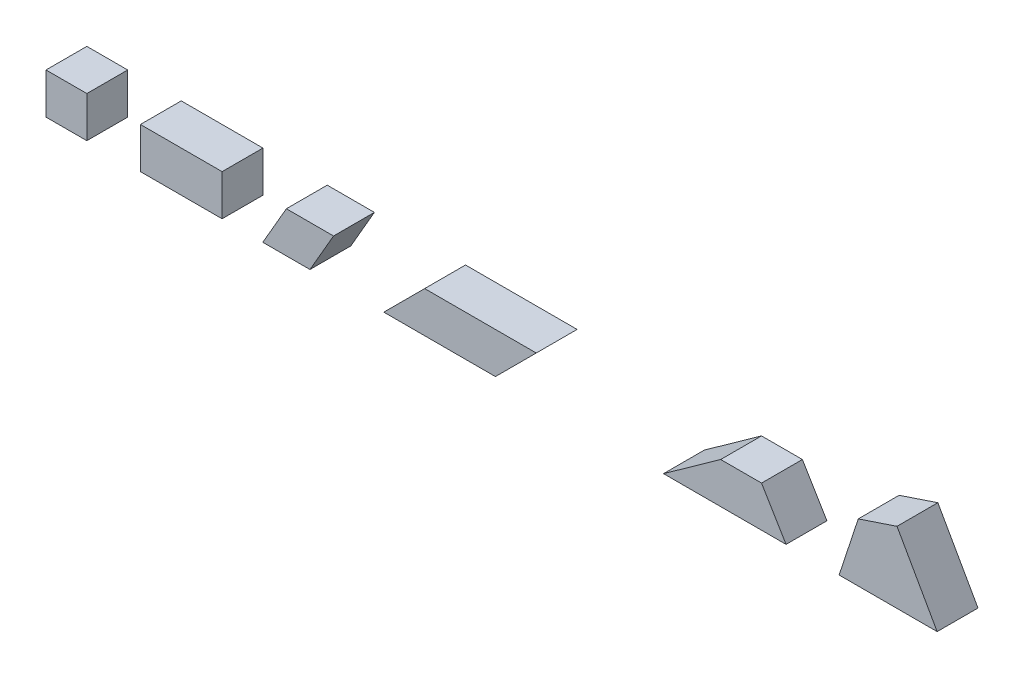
ISO-10303-21;
HEADER;
FILE_DESCRIPTION(('STEP AP214'),'2;1');
FILE_NAME('part.step','',(''),(''),'','','');
FILE_SCHEMA(('AUTOMOTIVE_DESIGN { 1 0 10303 214 1 1 1 1 }'));
ENDSEC;
DATA;
#1=APPLICATION_CONTEXT('core data for automotive mechanical design processes');
#2=APPLICATION_PROTOCOL_DEFINITION('international standard','automotive_design',2000,#1);
#3=PRODUCT_CONTEXT('',#1,'mechanical');
#4=PRODUCT('Part','Part','',(#3));
#5=PRODUCT_RELATED_PRODUCT_CATEGORY('part','',(#4));
#6=PRODUCT_DEFINITION_FORMATION('','',#4);
#7=PRODUCT_DEFINITION_CONTEXT('part definition',#1,'design');
#8=PRODUCT_DEFINITION('design','',#6,#7);
#9=PRODUCT_DEFINITION_SHAPE('','',#8);
#10=(LENGTH_UNIT() NAMED_UNIT(*) SI_UNIT(.MILLI.,.METRE.));
#11=(NAMED_UNIT(*) PLANE_ANGLE_UNIT() SI_UNIT($,.RADIAN.));
#12=(NAMED_UNIT(*) SI_UNIT($,.STERADIAN.) SOLID_ANGLE_UNIT());
#13=UNCERTAINTY_MEASURE_WITH_UNIT(LENGTH_MEASURE(1.E-05),#10,'distance_accuracy_value','');
#14=(GEOMETRIC_REPRESENTATION_CONTEXT(3) GLOBAL_UNCERTAINTY_ASSIGNED_CONTEXT((#13)) GLOBAL_UNIT_ASSIGNED_CONTEXT((#10,
#11,#12)) REPRESENTATION_CONTEXT('',''));
#15=CARTESIAN_POINT('',(0.,0.,0.));
#16=DIRECTION('',(0.,0.,1.));
#17=DIRECTION('',(1.,0.,0.));
#18=AXIS2_PLACEMENT_3D('',#15,#16,#17);
#19=CARTESIAN_POINT('',(994.197649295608,71.2438319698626,50.));
#20=DIRECTION('',(0.949917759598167,-0.312499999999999,0.));
#21=DIRECTION('',(0.312499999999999,0.949917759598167,0.));
#22=AXIS2_PLACEMENT_3D('',#19,#20,#21);
#23=PLANE('',#22);
#24=DIRECTION('',(-0.312499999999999,-0.949917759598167,0.));
#25=VECTOR('',#24,1.);
#26=CARTESIAN_POINT('',(994.197649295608,71.2438319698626,0.));
#27=LINE('',#26,#25);
#28=CARTESIAN_POINT('',(994.197649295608,71.2438319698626,0.));
#29=VERTEX_POINT('',#28);
#30=CARTESIAN_POINT('',(970.760149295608,0.,0.));
#31=VERTEX_POINT('',#30);
#32=EDGE_CURVE('E86',#29,#31,#27,.T.);
#33=ORIENTED_EDGE('',*,*,#32,.T.);
#34=DIRECTION('',(0.,0.,-1.));
#35=VECTOR('',#34,1.);
#36=CARTESIAN_POINT('',(970.760149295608,0.,50.));
#37=LINE('',#36,#35);
#38=CARTESIAN_POINT('',(970.760149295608,0.,50.));
#39=VERTEX_POINT('',#38);
#40=EDGE_CURVE('E12',#39,#31,#37,.T.);
#41=ORIENTED_EDGE('',*,*,#40,.F.);
#42=DIRECTION('',(-0.312499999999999,-0.949917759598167,0.));
#43=VECTOR('',#42,1.);
#44=CARTESIAN_POINT('',(994.197649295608,71.2438319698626,50.));
#45=LINE('',#44,#43);
#46=CARTESIAN_POINT('',(994.197649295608,71.2438319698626,50.));
#47=VERTEX_POINT('',#46);
#48=EDGE_CURVE('E104',#47,#39,#45,.T.);
#49=ORIENTED_EDGE('',*,*,#48,.F.);
#50=DIRECTION('',(0.,0.,-1.));
#51=VECTOR('',#50,1.);
#52=CARTESIAN_POINT('',(994.197649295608,71.2438319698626,50.));
#53=LINE('',#52,#51);
#54=EDGE_CURVE('E98',#47,#29,#53,.T.);
#55=ORIENTED_EDGE('',*,*,#54,.T.);
#56=EDGE_LOOP('',(#33,#41,#49,#55));
#57=FACE_BOUND('',#56,.T.);
#58=ADVANCED_FACE('F42',(#57),#23,.F.);
#59=CARTESIAN_POINT('',(970.760149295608,0.,50.));
#60=DIRECTION('',(0.,1.,0.));
#61=DIRECTION('',(-1.,0.,0.));
#62=AXIS2_PLACEMENT_3D('',#59,#60,#61);
#63=PLANE('',#62);
#64=DIRECTION('',(1.,0.,0.));
#65=VECTOR('',#64,1.);
#66=CARTESIAN_POINT('',(970.760149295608,0.,0.));
#67=LINE('',#66,#65);
#68=CARTESIAN_POINT('',(1090.76014929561,0.,0.));
#69=VERTEX_POINT('',#68);
#70=EDGE_CURVE('E82',#31,#69,#67,.T.);
#71=ORIENTED_EDGE('',*,*,#70,.T.);
#72=DIRECTION('',(0.,0.,-1.));
#73=VECTOR('',#72,1.);
#74=CARTESIAN_POINT('',(1090.76014929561,0.,50.));
#75=LINE('',#74,#73);
#76=CARTESIAN_POINT('',(1090.76014929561,0.,50.));
#77=VERTEX_POINT('',#76);
#78=EDGE_CURVE('E49',#77,#69,#75,.T.);
#79=ORIENTED_EDGE('',*,*,#78,.F.);
#80=DIRECTION('',(1.,0.,0.));
#81=VECTOR('',#80,1.);
#82=CARTESIAN_POINT('',(970.760149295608,0.,50.));
#83=LINE('',#82,#81);
#84=EDGE_CURVE('E94',#39,#77,#83,.T.);
#85=ORIENTED_EDGE('',*,*,#84,.F.);
#86=ORIENTED_EDGE('',*,*,#40,.T.);
#87=EDGE_LOOP('',(#71,#79,#85,#86));
#88=FACE_BOUND('',#87,.T.);
#89=ADVANCED_FACE('F93',(#88),#63,.F.);
#90=CARTESIAN_POINT('',(1090.76014929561,0.,50.));
#91=DIRECTION('',(-0.8709288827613,-0.491409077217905,0.));
#92=DIRECTION('',(0.491409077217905,-0.8709288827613,0.));
#93=AXIS2_PLACEMENT_3D('',#90,#91,#92);
#94=PLANE('',#93);
#95=DIRECTION('',(-0.491409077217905,0.8709288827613,0.));
#96=VECTOR('',#95,1.);
#97=CARTESIAN_POINT('',(1090.76014929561,0.,0.));
#98=LINE('',#97,#96);
#99=CARTESIAN_POINT('',(1041.61924157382,87.0928882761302,0.));
#100=VERTEX_POINT('',#99);
#101=EDGE_CURVE('E87',#69,#100,#98,.T.);
#102=ORIENTED_EDGE('',*,*,#101,.T.);
#103=DIRECTION('',(0.,0.,-1.));
#104=VECTOR('',#103,1.);
#105=CARTESIAN_POINT('',(1041.61924157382,87.0928882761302,50.));
#106=LINE('',#105,#104);
#107=CARTESIAN_POINT('',(1041.61924157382,87.0928882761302,50.));
#108=VERTEX_POINT('',#107);
#109=EDGE_CURVE('E110',#108,#100,#106,.T.);
#110=ORIENTED_EDGE('',*,*,#109,.F.);
#111=DIRECTION('',(-0.491409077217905,0.8709288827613,0.));
#112=VECTOR('',#111,1.);
#113=CARTESIAN_POINT('',(1090.76014929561,0.,50.));
#114=LINE('',#113,#112);
#115=EDGE_CURVE('E61',#77,#108,#114,.T.);
#116=ORIENTED_EDGE('',*,*,#115,.F.);
#117=ORIENTED_EDGE('',*,*,#78,.T.);
#118=EDGE_LOOP('',(#102,#110,#116,#117));
#119=FACE_BOUND('',#118,.T.);
#120=ADVANCED_FACE('F113',(#119),#94,.F.);
#121=CARTESIAN_POINT('',(1041.61924157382,87.0928882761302,50.));
#122=DIRECTION('',(0.316981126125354,-0.948431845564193,0.));
#123=DIRECTION('',(0.948431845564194,0.316981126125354,0.));
#124=AXIS2_PLACEMENT_3D('',#121,#122,#123);
#125=PLANE('',#124);
#126=DIRECTION('',(-0.948431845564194,-0.316981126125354,0.));
#127=VECTOR('',#126,1.);
#128=CARTESIAN_POINT('',(1041.61924157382,87.0928882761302,0.));
#129=LINE('',#128,#127);
#130=EDGE_CURVE('E102',#100,#29,#129,.T.);
#131=ORIENTED_EDGE('',*,*,#130,.T.);
#132=ORIENTED_EDGE('',*,*,#54,.F.);
#133=DIRECTION('',(-0.948431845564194,-0.316981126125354,0.));
#134=VECTOR('',#133,1.);
#135=CARTESIAN_POINT('',(1041.61924157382,87.0928882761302,50.));
#136=LINE('',#135,#134);
#137=EDGE_CURVE('E56',#108,#47,#136,.T.);
#138=ORIENTED_EDGE('',*,*,#137,.F.);
#139=ORIENTED_EDGE('',*,*,#109,.T.);
#140=EDGE_LOOP('',(#131,#132,#138,#139));
#141=FACE_BOUND('',#140,.T.);
#142=ADVANCED_FACE('F115',(#141),#125,.F.);
#143=CARTESIAN_POINT('',(970.760149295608,0.,50.));
#144=DIRECTION('',(0.,0.,1.));
#145=DIRECTION('',(1.,0.,0.));
#146=AXIS2_PLACEMENT_3D('',#143,#144,#145);
#147=PLANE('',#146);
#148=ORIENTED_EDGE('',*,*,#48,.T.);
#149=ORIENTED_EDGE('',*,*,#84,.T.);
#150=ORIENTED_EDGE('',*,*,#115,.T.);
#151=ORIENTED_EDGE('',*,*,#137,.T.);
#152=EDGE_LOOP('',(#148,#149,#150,#151));
#153=FACE_BOUND('',#152,.T.);
#154=ADVANCED_FACE('F116',(#153),#147,.T.);
#155=CARTESIAN_POINT('',(970.760149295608,0.,0.));
#156=DIRECTION('',(0.,0.,1.));
#157=DIRECTION('',(1.,0.,0.));
#158=AXIS2_PLACEMENT_3D('',#155,#156,#157);
#159=PLANE('',#158);
#160=ORIENTED_EDGE('',*,*,#32,.F.);
#161=ORIENTED_EDGE('',*,*,#130,.F.);
#162=ORIENTED_EDGE('',*,*,#101,.F.);
#163=ORIENTED_EDGE('',*,*,#70,.F.);
#164=EDGE_LOOP('',(#160,#161,#162,#163));
#165=FACE_BOUND('',#164,.T.);
#166=ADVANCED_FACE('F83',(#165),#159,.F.);
#167=CLOSED_SHELL('',(#58,#89,#120,#142,#154,#166));
#168=MANIFOLD_SOLID_BREP('B2',#167);
#169=CARTESIAN_POINT('',(550.0755337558,0.,50.));
#170=DIRECTION('',(-0.707106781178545,0.707106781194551,0.));
#171=DIRECTION('',(-0.707106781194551,-0.707106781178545,0.));
#172=AXIS2_PLACEMENT_3D('',#169,#170,#171);
#173=PLANE('',#172);
#174=DIRECTION('',(0.707106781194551,0.707106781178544,0.));
#175=VECTOR('',#174,1.);
#176=CARTESIAN_POINT('',(550.0755337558,0.,0.));
#177=LINE('',#176,#175);
#178=CARTESIAN_POINT('',(550.0755337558,0.,0.));
#179=VERTEX_POINT('',#178);
#180=CARTESIAN_POINT('',(600.075533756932,50.,0.));
#181=VERTEX_POINT('',#180);
#182=EDGE_CURVE('E208',#179,#181,#177,.T.);
#183=ORIENTED_EDGE('',*,*,#182,.T.);
#184=DIRECTION('',(0.,0.,-1.));
#185=VECTOR('',#184,1.);
#186=CARTESIAN_POINT('',(600.075533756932,50.,50.));
#187=LINE('',#186,#185);
#188=CARTESIAN_POINT('',(600.075533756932,50.,50.));
#189=VERTEX_POINT('',#188);
#190=EDGE_CURVE('E40',#189,#181,#187,.T.);
#191=ORIENTED_EDGE('',*,*,#190,.F.);
#192=DIRECTION('',(0.707106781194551,0.707106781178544,0.));
#193=VECTOR('',#192,1.);
#194=CARTESIAN_POINT('',(550.0755337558,0.,50.));
#195=LINE('',#194,#193);
#196=CARTESIAN_POINT('',(550.0755337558,0.,50.));
#197=VERTEX_POINT('',#196);
#198=EDGE_CURVE('E226',#197,#189,#195,.T.);
#199=ORIENTED_EDGE('',*,*,#198,.F.);
#200=DIRECTION('',(0.,0.,-1.));
#201=VECTOR('',#200,1.);
#202=CARTESIAN_POINT('',(550.0755337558,0.,50.));
#203=LINE('',#202,#201);
#204=EDGE_CURVE('E220',#197,#179,#203,.T.);
#205=ORIENTED_EDGE('',*,*,#204,.T.);
#206=EDGE_LOOP('',(#183,#191,#199,#205));
#207=FACE_BOUND('',#206,.T.);
#208=ADVANCED_FACE('F164',(#207),#173,.F.);
#209=CARTESIAN_POINT('',(600.075533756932,50.,50.));
#210=DIRECTION('',(0.,-1.,0.));
#211=DIRECTION('',(0.,0.,-1.));
#212=AXIS2_PLACEMENT_3D('',#209,#210,#211);
#213=PLANE('',#212);
#214=DIRECTION('',(-1.,0.,0.));
#215=VECTOR('',#214,1.);
#216=CARTESIAN_POINT('',(600.075533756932,50.,0.));
#217=LINE('',#216,#215);
#218=CARTESIAN_POINT('',(463.472993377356,50.,0.));
#219=VERTEX_POINT('',#218);
#220=EDGE_CURVE('E204',#181,#219,#217,.T.);
#221=ORIENTED_EDGE('',*,*,#220,.T.);
#222=DIRECTION('',(0.,0.,-1.));
#223=VECTOR('',#222,1.);
#224=CARTESIAN_POINT('',(463.472993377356,50.,50.));
#225=LINE('',#224,#223);
#226=CARTESIAN_POINT('',(463.472993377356,50.,50.));
#227=VERTEX_POINT('',#226);
#228=EDGE_CURVE('E171',#227,#219,#225,.T.);
#229=ORIENTED_EDGE('',*,*,#228,.F.);
#230=DIRECTION('',(-1.,0.,0.));
#231=VECTOR('',#230,1.);
#232=CARTESIAN_POINT('',(600.075533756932,50.,50.));
#233=LINE('',#232,#231);
#234=EDGE_CURVE('E216',#189,#227,#233,.T.);
#235=ORIENTED_EDGE('',*,*,#234,.F.);
#236=ORIENTED_EDGE('',*,*,#190,.T.);
#237=EDGE_LOOP('',(#221,#229,#235,#236));
#238=FACE_BOUND('',#237,.T.);
#239=ADVANCED_FACE('F215',(#238),#213,.F.);
#240=CARTESIAN_POINT('',(463.472993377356,50.,50.));
#241=DIRECTION('',(0.707106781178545,-0.70710678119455,0.));
#242=DIRECTION('',(0.70710678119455,0.707106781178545,0.));
#243=AXIS2_PLACEMENT_3D('',#240,#241,#242);
#244=PLANE('',#243);
#245=DIRECTION('',(-0.70710678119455,-0.707106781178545,0.));
#246=VECTOR('',#245,1.);
#247=CARTESIAN_POINT('',(463.472993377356,50.,0.));
#248=LINE('',#247,#246);
#249=CARTESIAN_POINT('',(413.472993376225,0.,0.));
#250=VERTEX_POINT('',#249);
#251=EDGE_CURVE('E209',#219,#250,#248,.T.);
#252=ORIENTED_EDGE('',*,*,#251,.T.);
#253=DIRECTION('',(0.,0.,-1.));
#254=VECTOR('',#253,1.);
#255=CARTESIAN_POINT('',(413.472993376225,0.,50.));
#256=LINE('',#255,#254);
#257=CARTESIAN_POINT('',(413.472993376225,0.,50.));
#258=VERTEX_POINT('',#257);
#259=EDGE_CURVE('E232',#258,#250,#256,.T.);
#260=ORIENTED_EDGE('',*,*,#259,.F.);
#261=DIRECTION('',(-0.70710678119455,-0.707106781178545,0.));
#262=VECTOR('',#261,1.);
#263=CARTESIAN_POINT('',(463.472993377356,50.,50.));
#264=LINE('',#263,#262);
#265=EDGE_CURVE('E183',#227,#258,#264,.T.);
#266=ORIENTED_EDGE('',*,*,#265,.F.);
#267=ORIENTED_EDGE('',*,*,#228,.T.);
#268=EDGE_LOOP('',(#252,#260,#266,#267));
#269=FACE_BOUND('',#268,.T.);
#270=ADVANCED_FACE('F235',(#269),#244,.F.);
#271=CARTESIAN_POINT('',(413.472993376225,0.,50.));
#272=DIRECTION('',(0.,1.,0.));
#273=DIRECTION('',(0.,0.,1.));
#274=AXIS2_PLACEMENT_3D('',#271,#272,#273);
#275=PLANE('',#274);
#276=DIRECTION('',(1.,0.,0.));
#277=VECTOR('',#276,1.);
#278=CARTESIAN_POINT('',(413.472993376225,0.,0.));
#279=LINE('',#278,#277);
#280=EDGE_CURVE('E224',#250,#179,#279,.T.);
#281=ORIENTED_EDGE('',*,*,#280,.T.);
#282=ORIENTED_EDGE('',*,*,#204,.F.);
#283=DIRECTION('',(1.,0.,0.));
#284=VECTOR('',#283,1.);
#285=CARTESIAN_POINT('',(413.472993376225,0.,50.));
#286=LINE('',#285,#284);
#287=EDGE_CURVE('E178',#258,#197,#286,.T.);
#288=ORIENTED_EDGE('',*,*,#287,.F.);
#289=ORIENTED_EDGE('',*,*,#259,.T.);
#290=EDGE_LOOP('',(#281,#282,#288,#289));
#291=FACE_BOUND('',#290,.T.);
#292=ADVANCED_FACE('F237',(#291),#275,.F.);
#293=CARTESIAN_POINT('',(600.075533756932,50.,50.));
#294=DIRECTION('',(0.,0.,1.));
#295=DIRECTION('',(1.,0.,0.));
#296=AXIS2_PLACEMENT_3D('',#293,#294,#295);
#297=PLANE('',#296);
#298=ORIENTED_EDGE('',*,*,#198,.T.);
#299=ORIENTED_EDGE('',*,*,#234,.T.);
#300=ORIENTED_EDGE('',*,*,#265,.T.);
#301=ORIENTED_EDGE('',*,*,#287,.T.);
#302=EDGE_LOOP('',(#298,#299,#300,#301));
#303=FACE_BOUND('',#302,.T.);
#304=ADVANCED_FACE('F238',(#303),#297,.T.);
#305=CARTESIAN_POINT('',(600.075533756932,50.,0.));
#306=DIRECTION('',(0.,0.,1.));
#307=DIRECTION('',(1.,0.,0.));
#308=AXIS2_PLACEMENT_3D('',#305,#306,#307);
#309=PLANE('',#308);
#310=ORIENTED_EDGE('',*,*,#182,.F.);
#311=ORIENTED_EDGE('',*,*,#280,.F.);
#312=ORIENTED_EDGE('',*,*,#251,.F.);
#313=ORIENTED_EDGE('',*,*,#220,.F.);
#314=EDGE_LOOP('',(#310,#311,#312,#313));
#315=FACE_BOUND('',#314,.T.);
#316=ADVANCED_FACE('F205',(#315),#309,.F.);
#317=CLOSED_SHELL('',(#208,#239,#270,#292,#304,#316));
#318=MANIFOLD_SOLID_BREP('B6',#317);
#319=CARTESIAN_POINT('',(323.086690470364,0.,50.));
#320=DIRECTION('',(-0.866025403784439,0.499999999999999,0.));
#321=DIRECTION('',(-0.5,-0.866025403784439,0.));
#322=AXIS2_PLACEMENT_3D('',#319,#320,#321);
#323=PLANE('',#322);
#324=DIRECTION('',(0.499999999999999,0.866025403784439,0.));
#325=VECTOR('',#324,1.);
#326=CARTESIAN_POINT('',(323.086690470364,0.,0.));
#327=LINE('',#326,#325);
#328=CARTESIAN_POINT('',(323.086690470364,0.,0.));
#329=VERTEX_POINT('',#328);
#330=CARTESIAN_POINT('',(351.954203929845,50.,0.));
#331=VERTEX_POINT('',#330);
#332=EDGE_CURVE('E330',#329,#331,#327,.T.);
#333=ORIENTED_EDGE('',*,*,#332,.T.);
#334=DIRECTION('',(0.,0.,-1.));
#335=VECTOR('',#334,1.);
#336=CARTESIAN_POINT('',(351.954203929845,50.,50.));
#337=LINE('',#336,#335);
#338=CARTESIAN_POINT('',(351.954203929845,50.,50.));
#339=VERTEX_POINT('',#338);
#340=EDGE_CURVE('E162',#339,#331,#337,.T.);
#341=ORIENTED_EDGE('',*,*,#340,.F.);
#342=DIRECTION('',(0.499999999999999,0.866025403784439,0.));
#343=VECTOR('',#342,1.);
#344=CARTESIAN_POINT('',(323.086690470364,0.,50.));
#345=LINE('',#344,#343);
#346=CARTESIAN_POINT('',(323.086690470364,0.,50.));
#347=VERTEX_POINT('',#346);
#348=EDGE_CURVE('E348',#347,#339,#345,.T.);
#349=ORIENTED_EDGE('',*,*,#348,.F.);
#350=DIRECTION('',(0.,0.,-1.));
#351=VECTOR('',#350,1.);
#352=CARTESIAN_POINT('',(323.086690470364,0.,50.));
#353=LINE('',#352,#351);
#354=EDGE_CURVE('E342',#347,#329,#353,.T.);
#355=ORIENTED_EDGE('',*,*,#354,.T.);
#356=EDGE_LOOP('',(#333,#341,#349,#355));
#357=FACE_BOUND('',#356,.T.);
#358=ADVANCED_FACE('F286',(#357),#323,.F.);
#359=CARTESIAN_POINT('',(351.954203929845,50.,50.));
#360=DIRECTION('',(0.,-1.,0.));
#361=DIRECTION('',(1.,0.,0.));
#362=AXIS2_PLACEMENT_3D('',#359,#360,#361);
#363=PLANE('',#362);
#364=DIRECTION('',(-1.,0.,0.));
#365=VECTOR('',#364,1.);
#366=CARTESIAN_POINT('',(351.954203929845,50.,0.));
#367=LINE('',#366,#365);
#368=CARTESIAN_POINT('',(294.219177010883,50.,0.));
#369=VERTEX_POINT('',#368);
#370=EDGE_CURVE('E326',#331,#369,#367,.T.);
#371=ORIENTED_EDGE('',*,*,#370,.T.);
#372=DIRECTION('',(0.,0.,-1.));
#373=VECTOR('',#372,1.);
#374=CARTESIAN_POINT('',(294.219177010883,50.,50.));
#375=LINE('',#374,#373);
#376=CARTESIAN_POINT('',(294.219177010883,50.,50.));
#377=VERTEX_POINT('',#376);
#378=EDGE_CURVE('E293',#377,#369,#375,.T.);
#379=ORIENTED_EDGE('',*,*,#378,.F.);
#380=DIRECTION('',(-1.,0.,0.));
#381=VECTOR('',#380,1.);
#382=CARTESIAN_POINT('',(351.954203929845,50.,50.));
#383=LINE('',#382,#381);
#384=EDGE_CURVE('E338',#339,#377,#383,.T.);
#385=ORIENTED_EDGE('',*,*,#384,.F.);
#386=ORIENTED_EDGE('',*,*,#340,.T.);
#387=EDGE_LOOP('',(#371,#379,#385,#386));
#388=FACE_BOUND('',#387,.T.);
#389=ADVANCED_FACE('F337',(#388),#363,.F.);
#390=CARTESIAN_POINT('',(294.219177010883,50.,50.));
#391=DIRECTION('',(0.866025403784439,-0.499999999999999,0.));
#392=DIRECTION('',(0.499999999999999,0.866025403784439,0.));
#393=AXIS2_PLACEMENT_3D('',#390,#391,#392);
#394=PLANE('',#393);
#395=DIRECTION('',(-0.499999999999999,-0.866025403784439,0.));
#396=VECTOR('',#395,1.);
#397=CARTESIAN_POINT('',(294.219177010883,50.,0.));
#398=LINE('',#397,#396);
#399=CARTESIAN_POINT('',(265.351663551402,0.,0.));
#400=VERTEX_POINT('',#399);
#401=EDGE_CURVE('E331',#369,#400,#398,.T.);
#402=ORIENTED_EDGE('',*,*,#401,.T.);
#403=DIRECTION('',(0.,0.,-1.));
#404=VECTOR('',#403,1.);
#405=CARTESIAN_POINT('',(265.351663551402,0.,50.));
#406=LINE('',#405,#404);
#407=CARTESIAN_POINT('',(265.351663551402,0.,50.));
#408=VERTEX_POINT('',#407);
#409=EDGE_CURVE('E354',#408,#400,#406,.T.);
#410=ORIENTED_EDGE('',*,*,#409,.F.);
#411=DIRECTION('',(-0.499999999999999,-0.866025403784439,0.));
#412=VECTOR('',#411,1.);
#413=CARTESIAN_POINT('',(294.219177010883,50.,50.));
#414=LINE('',#413,#412);
#415=EDGE_CURVE('E305',#377,#408,#414,.T.);
#416=ORIENTED_EDGE('',*,*,#415,.F.);
#417=ORIENTED_EDGE('',*,*,#378,.T.);
#418=EDGE_LOOP('',(#402,#410,#416,#417));
#419=FACE_BOUND('',#418,.T.);
#420=ADVANCED_FACE('F357',(#419),#394,.F.);
#421=CARTESIAN_POINT('',(265.351663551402,0.,50.));
#422=DIRECTION('',(0.,1.,0.));
#423=DIRECTION('',(-1.,0.,0.));
#424=AXIS2_PLACEMENT_3D('',#421,#422,#423);
#425=PLANE('',#424);
#426=DIRECTION('',(1.,0.,0.));
#427=VECTOR('',#426,1.);
#428=CARTESIAN_POINT('',(265.351663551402,0.,0.));
#429=LINE('',#428,#427);
#430=EDGE_CURVE('E346',#400,#329,#429,.T.);
#431=ORIENTED_EDGE('',*,*,#430,.T.);
#432=ORIENTED_EDGE('',*,*,#354,.F.);
#433=DIRECTION('',(1.,0.,0.));
#434=VECTOR('',#433,1.);
#435=CARTESIAN_POINT('',(265.351663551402,0.,50.));
#436=LINE('',#435,#434);
#437=EDGE_CURVE('E300',#408,#347,#436,.T.);
#438=ORIENTED_EDGE('',*,*,#437,.F.);
#439=ORIENTED_EDGE('',*,*,#409,.T.);
#440=EDGE_LOOP('',(#431,#432,#438,#439));
#441=FACE_BOUND('',#440,.T.);
#442=ADVANCED_FACE('F359',(#441),#425,.F.);
#443=CARTESIAN_POINT('',(351.954203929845,50.,50.));
#444=DIRECTION('',(0.,0.,1.));
#445=DIRECTION('',(1.,0.,0.));
#446=AXIS2_PLACEMENT_3D('',#443,#444,#445);
#447=PLANE('',#446);
#448=ORIENTED_EDGE('',*,*,#348,.T.);
#449=ORIENTED_EDGE('',*,*,#384,.T.);
#450=ORIENTED_EDGE('',*,*,#415,.T.);
#451=ORIENTED_EDGE('',*,*,#437,.T.);
#452=EDGE_LOOP('',(#448,#449,#450,#451));
#453=FACE_BOUND('',#452,.T.);
#454=ADVANCED_FACE('F360',(#453),#447,.T.);
#455=CARTESIAN_POINT('',(351.954203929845,50.,0.));
#456=DIRECTION('',(0.,0.,1.));
#457=DIRECTION('',(1.,0.,0.));
#458=AXIS2_PLACEMENT_3D('',#455,#456,#457);
#459=PLANE('',#458);
#460=ORIENTED_EDGE('',*,*,#332,.F.);
#461=ORIENTED_EDGE('',*,*,#430,.F.);
#462=ORIENTED_EDGE('',*,*,#401,.F.);
#463=ORIENTED_EDGE('',*,*,#370,.F.);
#464=EDGE_LOOP('',(#460,#461,#462,#463));
#465=FACE_BOUND('',#464,.T.);
#466=ADVANCED_FACE('F327',(#465),#459,.F.);
#467=CLOSED_SHELL('',(#358,#389,#420,#442,#454,#466));
#468=MANIFOLD_SOLID_BREP('B34',#467);
#469=CARTESIAN_POINT('',(825.828612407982,50.,50.));
#470=DIRECTION('',(0.581238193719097,-0.813733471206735,0.));
#471=DIRECTION('',(0.813733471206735,0.581238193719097,0.));
#472=AXIS2_PLACEMENT_3D('',#469,#470,#471);
#473=PLANE('',#472);
#474=DIRECTION('',(-0.813733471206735,-0.581238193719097,0.));
#475=VECTOR('',#474,1.);
#476=CARTESIAN_POINT('',(825.828612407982,50.,0.));
#477=LINE('',#476,#475);
#478=CARTESIAN_POINT('',(825.828612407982,50.,0.));
#479=VERTEX_POINT('',#478);
#480=CARTESIAN_POINT('',(755.828612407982,0.,0.));
#481=VERTEX_POINT('',#480);
#482=EDGE_CURVE('E452',#479,#481,#477,.T.);
#483=ORIENTED_EDGE('',*,*,#482,.T.);
#484=DIRECTION('',(0.,0.,-1.));
#485=VECTOR('',#484,1.);
#486=CARTESIAN_POINT('',(755.828612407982,0.,50.));
#487=LINE('',#486,#485);
#488=CARTESIAN_POINT('',(755.828612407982,0.,50.));
#489=VERTEX_POINT('',#488);
#490=EDGE_CURVE('E284',#489,#481,#487,.T.);
#491=ORIENTED_EDGE('',*,*,#490,.F.);
#492=DIRECTION('',(-0.813733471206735,-0.581238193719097,0.));
#493=VECTOR('',#492,1.);
#494=CARTESIAN_POINT('',(825.828612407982,50.,50.));
#495=LINE('',#494,#493);
#496=CARTESIAN_POINT('',(825.828612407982,50.,50.));
#497=VERTEX_POINT('',#496);
#498=EDGE_CURVE('E470',#497,#489,#495,.T.);
#499=ORIENTED_EDGE('',*,*,#498,.F.);
#500=DIRECTION('',(0.,0.,-1.));
#501=VECTOR('',#500,1.);
#502=CARTESIAN_POINT('',(825.828612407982,50.,50.));
#503=LINE('',#502,#501);
#504=EDGE_CURVE('E464',#497,#479,#503,.T.);
#505=ORIENTED_EDGE('',*,*,#504,.T.);
#506=EDGE_LOOP('',(#483,#491,#499,#505));
#507=FACE_BOUND('',#506,.T.);
#508=ADVANCED_FACE('F408',(#507),#473,.F.);
#509=CARTESIAN_POINT('',(755.828612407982,0.,50.));
#510=DIRECTION('',(0.,1.,0.));
#511=DIRECTION('',(-1.,0.,0.));
#512=AXIS2_PLACEMENT_3D('',#509,#510,#511);
#513=PLANE('',#512);
#514=DIRECTION('',(1.,0.,0.));
#515=VECTOR('',#514,1.);
#516=CARTESIAN_POINT('',(755.828612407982,0.,0.));
#517=LINE('',#516,#515);
#518=CARTESIAN_POINT('',(905.828612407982,0.,0.));
#519=VERTEX_POINT('',#518);
#520=EDGE_CURVE('E448',#481,#519,#517,.T.);
#521=ORIENTED_EDGE('',*,*,#520,.T.);
#522=DIRECTION('',(0.,0.,-1.));
#523=VECTOR('',#522,1.);
#524=CARTESIAN_POINT('',(905.828612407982,0.,50.));
#525=LINE('',#524,#523);
#526=CARTESIAN_POINT('',(905.828612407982,0.,50.));
#527=VERTEX_POINT('',#526);
#528=EDGE_CURVE('E415',#527,#519,#525,.T.);
#529=ORIENTED_EDGE('',*,*,#528,.F.);
#530=DIRECTION('',(1.,0.,0.));
#531=VECTOR('',#530,1.);
#532=CARTESIAN_POINT('',(755.828612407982,0.,50.));
#533=LINE('',#532,#531);
#534=EDGE_CURVE('E460',#489,#527,#533,.T.);
#535=ORIENTED_EDGE('',*,*,#534,.F.);
#536=ORIENTED_EDGE('',*,*,#490,.T.);
#537=EDGE_LOOP('',(#521,#529,#535,#536));
#538=FACE_BOUND('',#537,.T.);
#539=ADVANCED_FACE('F459',(#538),#513,.F.);
#540=CARTESIAN_POINT('',(905.828612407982,0.,50.));
#541=DIRECTION('',(-0.857492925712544,-0.514495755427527,0.));
#542=DIRECTION('',(0.514495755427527,-0.857492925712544,0.));
#543=AXIS2_PLACEMENT_3D('',#540,#541,#542);
#544=PLANE('',#543);
#545=DIRECTION('',(-0.514495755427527,0.857492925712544,0.));
#546=VECTOR('',#545,1.);
#547=CARTESIAN_POINT('',(905.828612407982,0.,0.));
#548=LINE('',#547,#546);
#549=CARTESIAN_POINT('',(875.828612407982,50.,0.));
#550=VERTEX_POINT('',#549);
#551=EDGE_CURVE('E453',#519,#550,#548,.T.);
#552=ORIENTED_EDGE('',*,*,#551,.T.);
#553=DIRECTION('',(0.,0.,-1.));
#554=VECTOR('',#553,1.);
#555=CARTESIAN_POINT('',(875.828612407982,50.,50.));
#556=LINE('',#555,#554);
#557=CARTESIAN_POINT('',(875.828612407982,50.,50.));
#558=VERTEX_POINT('',#557);
#559=EDGE_CURVE('E476',#558,#550,#556,.T.);
#560=ORIENTED_EDGE('',*,*,#559,.F.);
#561=DIRECTION('',(-0.514495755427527,0.857492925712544,0.));
#562=VECTOR('',#561,1.);
#563=CARTESIAN_POINT('',(905.828612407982,0.,50.));
#564=LINE('',#563,#562);
#565=EDGE_CURVE('E427',#527,#558,#564,.T.);
#566=ORIENTED_EDGE('',*,*,#565,.F.);
#567=ORIENTED_EDGE('',*,*,#528,.T.);
#568=EDGE_LOOP('',(#552,#560,#566,#567));
#569=FACE_BOUND('',#568,.T.);
#570=ADVANCED_FACE('F479',(#569),#544,.F.);
#571=CARTESIAN_POINT('',(875.828612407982,50.,50.));
#572=DIRECTION('',(0.,-1.,0.));
#573=DIRECTION('',(0.,0.,-1.));
#574=AXIS2_PLACEMENT_3D('',#571,#572,#573);
#575=PLANE('',#574);
#576=DIRECTION('',(-1.,0.,0.));
#577=VECTOR('',#576,1.);
#578=CARTESIAN_POINT('',(875.828612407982,50.,0.));
#579=LINE('',#578,#577);
#580=EDGE_CURVE('E468',#550,#479,#579,.T.);
#581=ORIENTED_EDGE('',*,*,#580,.T.);
#582=ORIENTED_EDGE('',*,*,#504,.F.);
#583=DIRECTION('',(-1.,0.,0.));
#584=VECTOR('',#583,1.);
#585=CARTESIAN_POINT('',(875.828612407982,50.,50.));
#586=LINE('',#585,#584);
#587=EDGE_CURVE('E422',#558,#497,#586,.T.);
#588=ORIENTED_EDGE('',*,*,#587,.F.);
#589=ORIENTED_EDGE('',*,*,#559,.T.);
#590=EDGE_LOOP('',(#581,#582,#588,#589));
#591=FACE_BOUND('',#590,.T.);
#592=ADVANCED_FACE('F481',(#591),#575,.F.);
#593=CARTESIAN_POINT('',(860.828612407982,75.,50.));
#594=DIRECTION('',(0.,0.,-1.));
#595=DIRECTION('',(-1.,0.,0.));
#596=AXIS2_PLACEMENT_3D('',#593,#594,#595);
#597=PLANE('',#596);
#598=ORIENTED_EDGE('',*,*,#498,.T.);
#599=ORIENTED_EDGE('',*,*,#534,.T.);
#600=ORIENTED_EDGE('',*,*,#565,.T.);
#601=ORIENTED_EDGE('',*,*,#587,.T.);
#602=EDGE_LOOP('',(#598,#599,#600,#601));
#603=FACE_BOUND('',#602,.T.);
#604=ADVANCED_FACE('F482',(#603),#597,.F.);
#605=CARTESIAN_POINT('',(860.828612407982,75.,0.));
#606=DIRECTION('',(0.,0.,-1.));
#607=DIRECTION('',(-1.,0.,0.));
#608=AXIS2_PLACEMENT_3D('',#605,#606,#607);
#609=PLANE('',#608);
#610=ORIENTED_EDGE('',*,*,#482,.F.);
#611=ORIENTED_EDGE('',*,*,#580,.F.);
#612=ORIENTED_EDGE('',*,*,#551,.F.);
#613=ORIENTED_EDGE('',*,*,#520,.F.);
#614=EDGE_LOOP('',(#610,#611,#612,#613));
#615=FACE_BOUND('',#614,.T.);
#616=ADVANCED_FACE('F449',(#615),#609,.T.);
#617=CLOSED_SHELL('',(#508,#539,#570,#592,#604,#616));
#618=MANIFOLD_SOLID_BREP('B156',#617);
#619=CARTESIAN_POINT('',(115.547306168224,50.,50.));
#620=DIRECTION('',(1.,0.,0.));
#621=DIRECTION('',(0.,0.,-1.));
#622=AXIS2_PLACEMENT_3D('',#619,#620,#621);
#623=PLANE('',#622);
#624=DIRECTION('',(0.,-1.,0.));
#625=VECTOR('',#624,1.);
#626=CARTESIAN_POINT('',(115.547306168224,50.,0.));
#627=LINE('',#626,#625);
#628=CARTESIAN_POINT('',(115.547306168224,50.,0.));
#629=VERTEX_POINT('',#628);
#630=CARTESIAN_POINT('',(115.547306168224,0.,0.));
#631=VERTEX_POINT('',#630);
#632=EDGE_CURVE('E573',#629,#631,#627,.T.);
#633=ORIENTED_EDGE('',*,*,#632,.T.);
#634=DIRECTION('',(0.,0.,-1.));
#635=VECTOR('',#634,1.);
#636=CARTESIAN_POINT('',(115.547306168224,0.,50.));
#637=LINE('',#636,#635);
#638=CARTESIAN_POINT('',(115.547306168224,0.,50.));
#639=VERTEX_POINT('',#638);
#640=EDGE_CURVE('E406',#639,#631,#637,.T.);
#641=ORIENTED_EDGE('',*,*,#640,.F.);
#642=DIRECTION('',(0.,-1.,0.));
#643=VECTOR('',#642,1.);
#644=CARTESIAN_POINT('',(115.547306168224,50.,50.));
#645=LINE('',#644,#643);
#646=CARTESIAN_POINT('',(115.547306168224,50.,50.));
#647=VERTEX_POINT('',#646);
#648=EDGE_CURVE('E591',#647,#639,#645,.T.);
#649=ORIENTED_EDGE('',*,*,#648,.F.);
#650=DIRECTION('',(0.,0.,-1.));
#651=VECTOR('',#650,1.);
#652=CARTESIAN_POINT('',(115.547306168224,50.,50.));
#653=LINE('',#652,#651);
#654=EDGE_CURVE('E585',#647,#629,#653,.T.);
#655=ORIENTED_EDGE('',*,*,#654,.T.);
#656=EDGE_LOOP('',(#633,#641,#649,#655));
#657=FACE_BOUND('',#656,.T.);
#658=ADVANCED_FACE('F529',(#657),#623,.F.);
#659=CARTESIAN_POINT('',(115.547306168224,0.,50.));
#660=DIRECTION('',(0.,1.,0.));
#661=DIRECTION('',(0.,0.,1.));
#662=AXIS2_PLACEMENT_3D('',#659,#660,#661);
#663=PLANE('',#662);
#664=DIRECTION('',(1.,0.,0.));
#665=VECTOR('',#664,1.);
#666=CARTESIAN_POINT('',(115.547306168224,0.,0.));
#667=LINE('',#666,#665);
#668=CARTESIAN_POINT('',(215.547306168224,0.,0.));
#669=VERTEX_POINT('',#668);
#670=EDGE_CURVE('E569',#631,#669,#667,.T.);
#671=ORIENTED_EDGE('',*,*,#670,.T.);
#672=DIRECTION('',(0.,0.,-1.));
#673=VECTOR('',#672,1.);
#674=CARTESIAN_POINT('',(215.547306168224,0.,50.));
#675=LINE('',#674,#673);
#676=CARTESIAN_POINT('',(215.547306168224,0.,50.));
#677=VERTEX_POINT('',#676);
#678=EDGE_CURVE('E536',#677,#669,#675,.T.);
#679=ORIENTED_EDGE('',*,*,#678,.F.);
#680=DIRECTION('',(1.,0.,0.));
#681=VECTOR('',#680,1.);
#682=CARTESIAN_POINT('',(115.547306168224,0.,50.));
#683=LINE('',#682,#681);
#684=EDGE_CURVE('E581',#639,#677,#683,.T.);
#685=ORIENTED_EDGE('',*,*,#684,.F.);
#686=ORIENTED_EDGE('',*,*,#640,.T.);
#687=EDGE_LOOP('',(#671,#679,#685,#686));
#688=FACE_BOUND('',#687,.T.);
#689=ADVANCED_FACE('F580',(#688),#663,.F.);
#690=CARTESIAN_POINT('',(215.547306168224,50.,50.));
#691=DIRECTION('',(-1.,0.,0.));
#692=DIRECTION('',(0.,0.,1.));
#693=AXIS2_PLACEMENT_3D('',#690,#691,#692);
#694=PLANE('',#693);
#695=DIRECTION('',(0.,1.,0.));
#696=VECTOR('',#695,1.);
#697=CARTESIAN_POINT('',(215.547306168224,50.,0.));
#698=LINE('',#697,#696);
#699=CARTESIAN_POINT('',(215.547306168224,50.,0.));
#700=VERTEX_POINT('',#699);
#701=EDGE_CURVE('E574',#669,#700,#698,.T.);
#702=ORIENTED_EDGE('',*,*,#701,.T.);
#703=DIRECTION('',(0.,0.,-1.));
#704=VECTOR('',#703,1.);
#705=CARTESIAN_POINT('',(215.547306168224,50.,50.));
#706=LINE('',#705,#704);
#707=CARTESIAN_POINT('',(215.547306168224,50.,50.));
#708=VERTEX_POINT('',#707);
#709=EDGE_CURVE('E597',#708,#700,#706,.T.);
#710=ORIENTED_EDGE('',*,*,#709,.F.);
#711=DIRECTION('',(0.,1.,0.));
#712=VECTOR('',#711,1.);
#713=CARTESIAN_POINT('',(215.547306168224,50.,50.));
#714=LINE('',#713,#712);
#715=EDGE_CURVE('E548',#677,#708,#714,.T.);
#716=ORIENTED_EDGE('',*,*,#715,.F.);
#717=ORIENTED_EDGE('',*,*,#678,.T.);
#718=EDGE_LOOP('',(#702,#710,#716,#717));
#719=FACE_BOUND('',#718,.T.);
#720=ADVANCED_FACE('F600',(#719),#694,.F.);
#721=CARTESIAN_POINT('',(115.547306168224,50.,50.));
#722=DIRECTION('',(0.,-1.,0.));
#723=DIRECTION('',(0.,0.,-1.));
#724=AXIS2_PLACEMENT_3D('',#721,#722,#723);
#725=PLANE('',#724);
#726=DIRECTION('',(-1.,0.,0.));
#727=VECTOR('',#726,1.);
#728=CARTESIAN_POINT('',(115.547306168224,50.,0.));
#729=LINE('',#728,#727);
#730=EDGE_CURVE('E589',#700,#629,#729,.T.);
#731=ORIENTED_EDGE('',*,*,#730,.T.);
#732=ORIENTED_EDGE('',*,*,#654,.F.);
#733=DIRECTION('',(-1.,0.,0.));
#734=VECTOR('',#733,1.);
#735=CARTESIAN_POINT('',(115.547306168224,50.,50.));
#736=LINE('',#735,#734);
#737=EDGE_CURVE('E543',#708,#647,#736,.T.);
#738=ORIENTED_EDGE('',*,*,#737,.F.);
#739=ORIENTED_EDGE('',*,*,#709,.T.);
#740=EDGE_LOOP('',(#731,#732,#738,#739));
#741=FACE_BOUND('',#740,.T.);
#742=ADVANCED_FACE('F602',(#741),#725,.F.);
#743=CARTESIAN_POINT('',(115.547306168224,0.,50.));
#744=DIRECTION('',(0.,0.,1.));
#745=DIRECTION('',(1.,0.,0.));
#746=AXIS2_PLACEMENT_3D('',#743,#744,#745);
#747=PLANE('',#746);
#748=ORIENTED_EDGE('',*,*,#648,.T.);
#749=ORIENTED_EDGE('',*,*,#684,.T.);
#750=ORIENTED_EDGE('',*,*,#715,.T.);
#751=ORIENTED_EDGE('',*,*,#737,.T.);
#752=EDGE_LOOP('',(#748,#749,#750,#751));
#753=FACE_BOUND('',#752,.T.);
#754=ADVANCED_FACE('F603',(#753),#747,.T.);
#755=CARTESIAN_POINT('',(115.547306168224,0.,0.));
#756=DIRECTION('',(0.,0.,1.));
#757=DIRECTION('',(1.,0.,0.));
#758=AXIS2_PLACEMENT_3D('',#755,#756,#757);
#759=PLANE('',#758);
#760=ORIENTED_EDGE('',*,*,#632,.F.);
#761=ORIENTED_EDGE('',*,*,#730,.F.);
#762=ORIENTED_EDGE('',*,*,#701,.F.);
#763=ORIENTED_EDGE('',*,*,#670,.F.);
#764=EDGE_LOOP('',(#760,#761,#762,#763));
#765=FACE_BOUND('',#764,.T.);
#766=ADVANCED_FACE('F570',(#765),#759,.F.);
#767=CLOSED_SHELL('',(#658,#689,#720,#742,#754,#766));
#768=MANIFOLD_SOLID_BREP('B278',#767);
#769=CARTESIAN_POINT('',(0.,0.,50.));
#770=DIRECTION('',(1.,0.,0.));
#771=DIRECTION('',(0.,0.,-1.));
#772=AXIS2_PLACEMENT_3D('',#769,#770,#771);
#773=PLANE('',#772);
#774=DIRECTION('',(0.,-1.,0.));
#775=VECTOR('',#774,1.);
#776=CARTESIAN_POINT('',(0.,0.,0.));
#777=LINE('',#776,#775);
#778=CARTESIAN_POINT('',(0.,50.,0.));
#779=VERTEX_POINT('',#778);
#780=CARTESIAN_POINT('',(0.,0.,0.));
#781=VERTEX_POINT('',#780);
#782=EDGE_CURVE('E685',#779,#781,#777,.T.);
#783=ORIENTED_EDGE('',*,*,#782,.T.);
#784=DIRECTION('',(0.,0.,-1.));
#785=VECTOR('',#784,1.);
#786=CARTESIAN_POINT('',(0.,0.,50.));
#787=LINE('',#786,#785);
#788=CARTESIAN_POINT('',(0.,0.,50.));
#789=VERTEX_POINT('',#788);
#790=EDGE_CURVE('E527',#789,#781,#787,.T.);
#791=ORIENTED_EDGE('',*,*,#790,.F.);
#792=DIRECTION('',(0.,-1.,0.));
#793=VECTOR('',#792,1.);
#794=CARTESIAN_POINT('',(0.,0.,50.));
#795=LINE('',#794,#793);
#796=CARTESIAN_POINT('',(0.,50.,50.));
#797=VERTEX_POINT('',#796);
#798=EDGE_CURVE('E703',#797,#789,#795,.T.);
#799=ORIENTED_EDGE('',*,*,#798,.F.);
#800=DIRECTION('',(0.,0.,-1.));
#801=VECTOR('',#800,1.);
#802=CARTESIAN_POINT('',(0.,50.,50.));
#803=LINE('',#802,#801);
#804=EDGE_CURVE('E697',#797,#779,#803,.T.);
#805=ORIENTED_EDGE('',*,*,#804,.T.);
#806=EDGE_LOOP('',(#783,#791,#799,#805));
#807=FACE_BOUND('',#806,.T.);
#808=ADVANCED_FACE('F641',(#807),#773,.F.);
#809=CARTESIAN_POINT('',(0.,0.,50.));
#810=DIRECTION('',(0.,1.,0.));
#811=DIRECTION('',(0.,0.,1.));
#812=AXIS2_PLACEMENT_3D('',#809,#810,#811);
#813=PLANE('',#812);
#814=DIRECTION('',(1.,0.,0.));
#815=VECTOR('',#814,1.);
#816=CARTESIAN_POINT('',(0.,0.,0.));
#817=LINE('',#816,#815);
#818=CARTESIAN_POINT('',(50.,0.,0.));
#819=VERTEX_POINT('',#818);
#820=EDGE_CURVE('E681',#781,#819,#817,.T.);
#821=ORIENTED_EDGE('',*,*,#820,.T.);
#822=DIRECTION('',(0.,0.,-1.));
#823=VECTOR('',#822,1.);
#824=CARTESIAN_POINT('',(50.,0.,50.));
#825=LINE('',#824,#823);
#826=CARTESIAN_POINT('',(50.,0.,50.));
#827=VERTEX_POINT('',#826);
#828=EDGE_CURVE('E648',#827,#819,#825,.T.);
#829=ORIENTED_EDGE('',*,*,#828,.F.);
#830=DIRECTION('',(1.,0.,0.));
#831=VECTOR('',#830,1.);
#832=CARTESIAN_POINT('',(0.,0.,50.));
#833=LINE('',#832,#831);
#834=EDGE_CURVE('E693',#789,#827,#833,.T.);
#835=ORIENTED_EDGE('',*,*,#834,.F.);
#836=ORIENTED_EDGE('',*,*,#790,.T.);
#837=EDGE_LOOP('',(#821,#829,#835,#836));
#838=FACE_BOUND('',#837,.T.);
#839=ADVANCED_FACE('F692',(#838),#813,.F.);
#840=CARTESIAN_POINT('',(50.,0.,50.));
#841=DIRECTION('',(-1.,0.,0.));
#842=DIRECTION('',(0.,0.,1.));
#843=AXIS2_PLACEMENT_3D('',#840,#841,#842);
#844=PLANE('',#843);
#845=DIRECTION('',(0.,1.,0.));
#846=VECTOR('',#845,1.);
#847=CARTESIAN_POINT('',(50.,0.,0.));
#848=LINE('',#847,#846);
#849=CARTESIAN_POINT('',(50.,50.,0.));
#850=VERTEX_POINT('',#849);
#851=EDGE_CURVE('E686',#819,#850,#848,.T.);
#852=ORIENTED_EDGE('',*,*,#851,.T.);
#853=DIRECTION('',(0.,0.,-1.));
#854=VECTOR('',#853,1.);
#855=CARTESIAN_POINT('',(50.,50.,50.));
#856=LINE('',#855,#854);
#857=CARTESIAN_POINT('',(50.,50.,50.));
#858=VERTEX_POINT('',#857);
#859=EDGE_CURVE('E709',#858,#850,#856,.T.);
#860=ORIENTED_EDGE('',*,*,#859,.F.);
#861=DIRECTION('',(0.,1.,0.));
#862=VECTOR('',#861,1.);
#863=CARTESIAN_POINT('',(50.,0.,50.));
#864=LINE('',#863,#862);
#865=EDGE_CURVE('E660',#827,#858,#864,.T.);
#866=ORIENTED_EDGE('',*,*,#865,.F.);
#867=ORIENTED_EDGE('',*,*,#828,.T.);
#868=EDGE_LOOP('',(#852,#860,#866,#867));
#869=FACE_BOUND('',#868,.T.);
#870=ADVANCED_FACE('F712',(#869),#844,.F.);
#871=CARTESIAN_POINT('',(0.,50.,50.));
#872=DIRECTION('',(0.,-1.,0.));
#873=DIRECTION('',(0.,0.,-1.));
#874=AXIS2_PLACEMENT_3D('',#871,#872,#873);
#875=PLANE('',#874);
#876=DIRECTION('',(-1.,0.,0.));
#877=VECTOR('',#876,1.);
#878=CARTESIAN_POINT('',(0.,50.,0.));
#879=LINE('',#878,#877);
#880=EDGE_CURVE('E701',#850,#779,#879,.T.);
#881=ORIENTED_EDGE('',*,*,#880,.T.);
#882=ORIENTED_EDGE('',*,*,#804,.F.);
#883=DIRECTION('',(-1.,0.,0.));
#884=VECTOR('',#883,1.);
#885=CARTESIAN_POINT('',(0.,50.,50.));
#886=LINE('',#885,#884);
#887=EDGE_CURVE('E655',#858,#797,#886,.T.);
#888=ORIENTED_EDGE('',*,*,#887,.F.);
#889=ORIENTED_EDGE('',*,*,#859,.T.);
#890=EDGE_LOOP('',(#881,#882,#888,#889));
#891=FACE_BOUND('',#890,.T.);
#892=ADVANCED_FACE('F714',(#891),#875,.F.);
#893=CARTESIAN_POINT('',(0.,50.,50.));
#894=DIRECTION('',(0.,0.,-1.));
#895=DIRECTION('',(-1.,0.,0.));
#896=AXIS2_PLACEMENT_3D('',#893,#894,#895);
#897=PLANE('',#896);
#898=ORIENTED_EDGE('',*,*,#798,.T.);
#899=ORIENTED_EDGE('',*,*,#834,.T.);
#900=ORIENTED_EDGE('',*,*,#865,.T.);
#901=ORIENTED_EDGE('',*,*,#887,.T.);
#902=EDGE_LOOP('',(#898,#899,#900,#901));
#903=FACE_BOUND('',#902,.T.);
#904=ADVANCED_FACE('F715',(#903),#897,.F.);
#905=CARTESIAN_POINT('',(0.,50.,0.));
#906=DIRECTION('',(0.,0.,-1.));
#907=DIRECTION('',(-1.,0.,0.));
#908=AXIS2_PLACEMENT_3D('',#905,#906,#907);
#909=PLANE('',#908);
#910=ORIENTED_EDGE('',*,*,#782,.F.);
#911=ORIENTED_EDGE('',*,*,#880,.F.);
#912=ORIENTED_EDGE('',*,*,#851,.F.);
#913=ORIENTED_EDGE('',*,*,#820,.F.);
#914=EDGE_LOOP('',(#910,#911,#912,#913));
#915=FACE_BOUND('',#914,.T.);
#916=ADVANCED_FACE('F682',(#915),#909,.T.);
#917=CLOSED_SHELL('',(#808,#839,#870,#892,#904,#916));
#918=MANIFOLD_SOLID_BREP('B400',#917);
#919=ADVANCED_BREP_SHAPE_REPRESENTATION('',(#18,#168,#318,#468,#618,#768,#918),#14);
#920=SHAPE_DEFINITION_REPRESENTATION(#9,#919);
ENDSEC;
END-ISO-10303-21;
